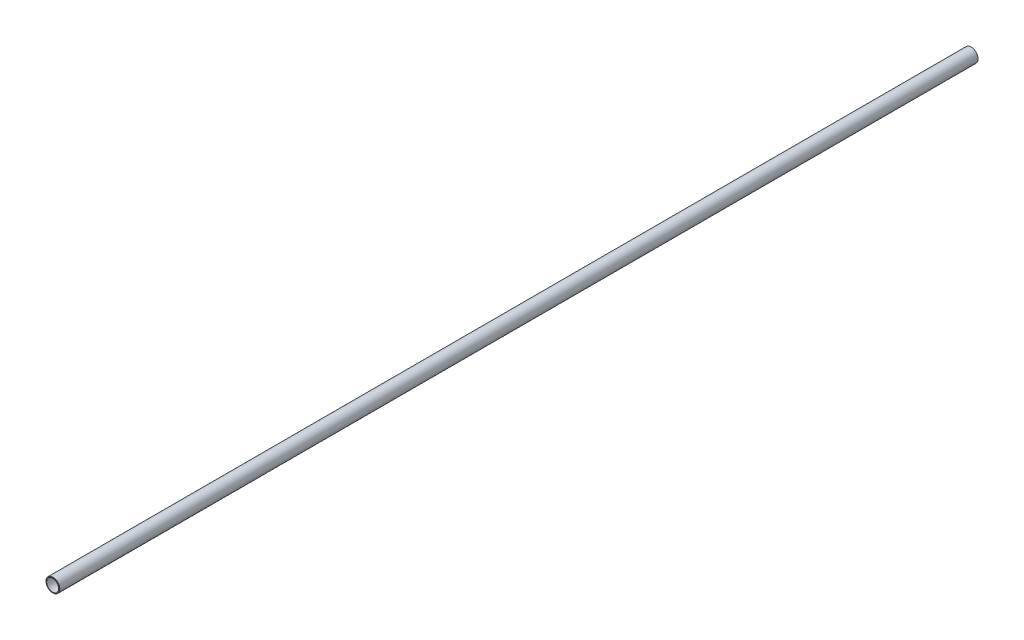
from build123d import *

# Parameters (mm, degrees)
ESQUISSE1_R        = 15
ESQUISSE1_R_2      = 13
BOSS_EXTRU_1_DEPTH = 2000
CHANFREIN1_SIZE    = 0.5


with BuildPart() as part:
    # Esquisse1 → Boss.-Extru.1 (new body)
    with BuildSketch(Plane.XY):
        Circle(ESQUISSE1_R)
        Circle(ESQUISSE1_R_2, mode=Mode.SUBTRACT)
    extrude(amount=BOSS_EXTRU_1_DEPTH)

    # Chanfrein1
    chanfrein1_edges = [part.edges().sort_by_distance(p)[0] for p in [
        (-15, 0, 0),
        (-15, 0, 2000),
    ]]
    chamfer(chanfrein1_edges, length=CHANFREIN1_SIZE)


solid = part.part
